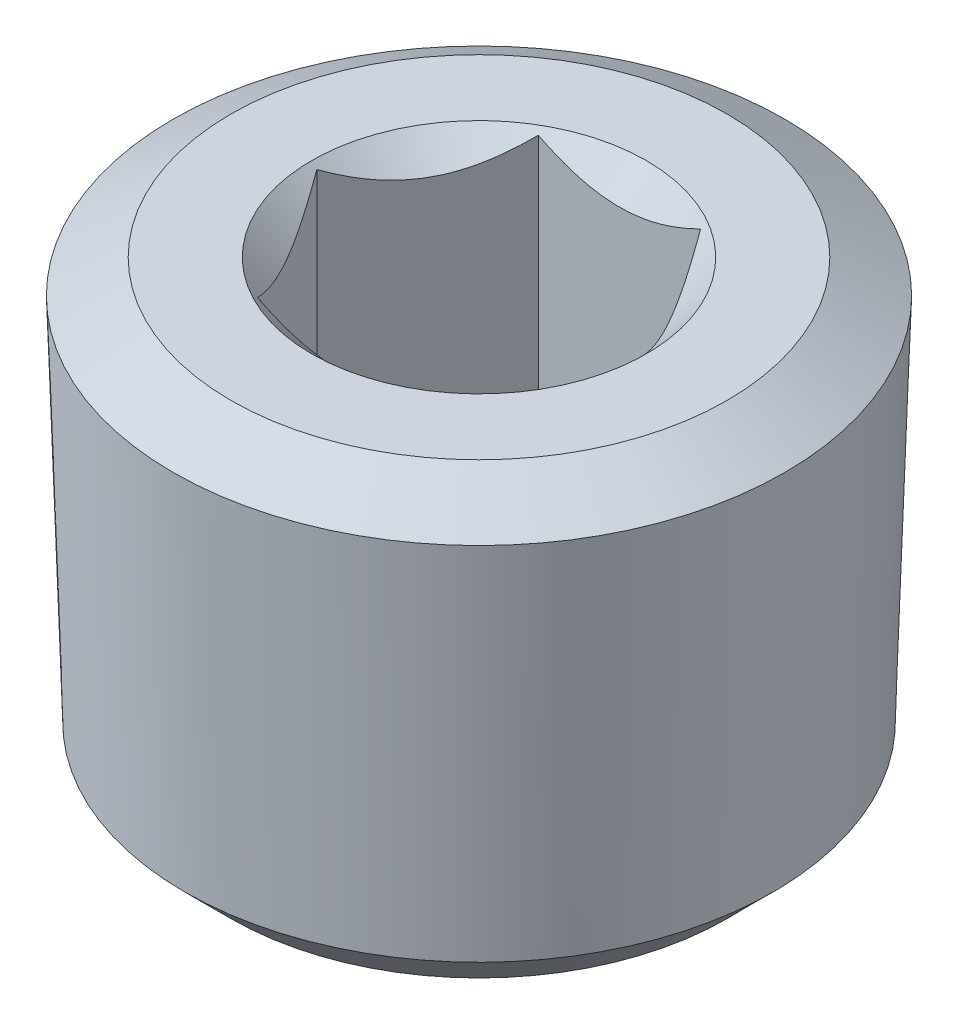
ISO-10303-21;
HEADER;
FILE_DESCRIPTION(('STEP AP214'),'2;1');
FILE_NAME('part.step','',(''),(''),'','','');
FILE_SCHEMA(('AUTOMOTIVE_DESIGN { 1 0 10303 214 1 1 1 1 }'));
ENDSEC;
DATA;
#1=APPLICATION_CONTEXT('core data for automotive mechanical design processes');
#2=APPLICATION_PROTOCOL_DEFINITION('international standard','automotive_design',2000,#1);
#3=PRODUCT_CONTEXT('',#1,'mechanical');
#4=PRODUCT('Part','Part','',(#3));
#5=PRODUCT_RELATED_PRODUCT_CATEGORY('part','',(#4));
#6=PRODUCT_DEFINITION_FORMATION('','',#4);
#7=PRODUCT_DEFINITION_CONTEXT('part definition',#1,'design');
#8=PRODUCT_DEFINITION('design','',#6,#7);
#9=PRODUCT_DEFINITION_SHAPE('','',#8);
#10=(LENGTH_UNIT() NAMED_UNIT(*) SI_UNIT(.MILLI.,.METRE.));
#11=(NAMED_UNIT(*) PLANE_ANGLE_UNIT() SI_UNIT($,.RADIAN.));
#12=(NAMED_UNIT(*) SI_UNIT($,.STERADIAN.) SOLID_ANGLE_UNIT());
#13=UNCERTAINTY_MEASURE_WITH_UNIT(LENGTH_MEASURE(1.E-05),#10,'distance_accuracy_value','');
#14=(GEOMETRIC_REPRESENTATION_CONTEXT(3) GLOBAL_UNCERTAINTY_ASSIGNED_CONTEXT((#13)) GLOBAL_UNIT_ASSIGNED_CONTEXT((#10,
#11,#12)) REPRESENTATION_CONTEXT('',''));
#15=CARTESIAN_POINT('',(0.,0.,0.));
#16=DIRECTION('',(0.,0.,1.));
#17=DIRECTION('',(1.,0.,0.));
#18=AXIS2_PLACEMENT_3D('',#15,#16,#17);
#19=CARTESIAN_POINT('',(0.,0.,0.));
#20=DIRECTION('',(0.,1.,0.));
#21=DIRECTION('',(0.,0.,1.));
#22=AXIS2_PLACEMENT_3D('',#19,#20,#21);
#23=PLANE('',#22);
#24=CARTESIAN_POINT('',(0.,0.,0.));
#25=DIRECTION('',(0.,1.,0.));
#26=DIRECTION('',(0.,0.,1.));
#27=AXIS2_PLACEMENT_3D('',#24,#25,#26);
#28=CIRCLE('',#27,4.7371);
#29=CARTESIAN_POINT('',(0.,0.,4.7371));
#30=VERTEX_POINT('',#29);
#31=EDGE_CURVE('E244',#30,#30,#28,.T.);
#32=ORIENTED_EDGE('',*,*,#31,.F.);
#33=EDGE_LOOP('',(#32));
#34=FACE_BOUND('',#33,.T.);
#35=CARTESIAN_POINT('',(0.,0.,0.));
#36=DIRECTION('',(0.,1.,0.));
#37=DIRECTION('',(0.,0.,1.));
#38=AXIS2_PLACEMENT_3D('',#35,#36,#37);
#39=CIRCLE('',#38,7.02034891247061);
#40=CARTESIAN_POINT('',(0.,0.,7.02034891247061));
#41=VERTEX_POINT('',#40);
#42=EDGE_CURVE('E12',#41,#41,#39,.T.);
#43=ORIENTED_EDGE('',*,*,#42,.T.);
#44=EDGE_LOOP('',(#43));
#45=FACE_BOUND('',#44,.T.);
#46=ADVANCED_FACE('F33',(#34,#45),#23,.T.);
#47=CARTESIAN_POINT('',(0.,0.,0.));
#48=DIRECTION('',(0.,-1.,0.));
#49=DIRECTION('',(0.,0.,-1.));
#50=AXIS2_PLACEMENT_3D('',#47,#48,#49);
#51=CONICAL_SURFACE('',#50,7.02034891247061,1.0471975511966);
#52=CARTESIAN_POINT('',(0.,-0.945092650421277,0.));
#53=DIRECTION('',(0.,1.,0.));
#54=DIRECTION('',(0.,0.,1.));
#55=AXIS2_PLACEMENT_3D('',#52,#53,#54);
#56=CIRCLE('',#55,8.65729740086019);
#57=CARTESIAN_POINT('',(0.,-0.945092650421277,8.65729740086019));
#58=VERTEX_POINT('',#57);
#59=EDGE_CURVE('E40',#58,#58,#56,.T.);
#60=ORIENTED_EDGE('',*,*,#59,.T.);
#61=EDGE_LOOP('',(#60));
#62=FACE_BOUND('',#61,.T.);
#63=ORIENTED_EDGE('',*,*,#42,.F.);
#64=EDGE_LOOP('',(#63));
#65=FACE_BOUND('',#64,.T.);
#66=ADVANCED_FACE('F234',(#62,#65),#51,.T.);
#67=CARTESIAN_POINT('',(0.,-0.945092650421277,0.));
#68=DIRECTION('',(0.,1.,0.));
#69=DIRECTION('',(0.,0.,1.));
#70=AXIS2_PLACEMENT_3D('',#67,#68,#69);
#71=CONICAL_SURFACE('',#70,8.65729740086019,0.0312064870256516);
#72=CARTESIAN_POINT('',(0.,-11.389077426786,0.));
#73=DIRECTION('',(0.,1.,0.));
#74=DIRECTION('',(0.,0.,1.));
#75=AXIS2_PLACEMENT_3D('',#72,#73,#74);
#76=CIRCLE('',#75,8.33127148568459);
#77=CARTESIAN_POINT('',(0.,-11.389077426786,8.33127148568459));
#78=VERTEX_POINT('',#77);
#79=EDGE_CURVE('E252',#78,#78,#76,.T.);
#80=ORIENTED_EDGE('',*,*,#79,.T.);
#81=EDGE_LOOP('',(#80));
#82=FACE_BOUND('',#81,.T.);
#83=ORIENTED_EDGE('',*,*,#59,.F.);
#84=EDGE_LOOP('',(#83));
#85=FACE_BOUND('',#84,.T.);
#86=ADVANCED_FACE('F239',(#82,#85),#71,.T.);
#87=CARTESIAN_POINT('',(0.,-11.389077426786,0.));
#88=DIRECTION('',(0.,1.,0.));
#89=DIRECTION('',(0.,0.,1.));
#90=AXIS2_PLACEMENT_3D('',#87,#88,#89);
#91=CONICAL_SURFACE('',#90,8.33127148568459,0.785398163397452);
#92=CARTESIAN_POINT('',(0.,-12.7,0.));
#93=DIRECTION('',(0.,1.,0.));
#94=DIRECTION('',(0.,0.,1.));
#95=AXIS2_PLACEMENT_3D('',#92,#93,#94);
#96=CIRCLE('',#95,7.02034891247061);
#97=CARTESIAN_POINT('',(0.,-12.7,7.02034891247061));
#98=VERTEX_POINT('',#97);
#99=EDGE_CURVE('E248',#98,#98,#96,.T.);
#100=ORIENTED_EDGE('',*,*,#99,.T.);
#101=EDGE_LOOP('',(#100));
#102=FACE_BOUND('',#101,.T.);
#103=ORIENTED_EDGE('',*,*,#79,.F.);
#104=EDGE_LOOP('',(#103));
#105=FACE_BOUND('',#104,.T.);
#106=ADVANCED_FACE('F263',(#102,#105),#91,.T.);
#107=CARTESIAN_POINT('',(-7.02034891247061,-12.7,0.));
#108=DIRECTION('',(0.,-1.,0.));
#109=DIRECTION('',(0.,0.,-1.));
#110=AXIS2_PLACEMENT_3D('',#107,#108,#109);
#111=PLANE('',#110);
#112=ORIENTED_EDGE('',*,*,#99,.F.);
#113=EDGE_LOOP('',(#112));
#114=FACE_BOUND('',#113,.T.);
#115=ADVANCED_FACE('F177',(#114),#111,.T.);
#116=CARTESIAN_POINT('',(0.,0.,0.));
#117=DIRECTION('',(0.,1.,0.));
#118=DIRECTION('',(0.,0.,1.));
#119=AXIS2_PLACEMENT_3D('',#116,#117,#118);
#120=CONICAL_SURFACE('',#119,4.7371,0.785398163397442);
#121=CARTESIAN_POINT('',(-4.84909764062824,1.53308085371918,3.9751));
#122=CARTESIAN_POINT('',(-4.73217167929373,1.44267539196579,3.9751));
#123=CARTESIAN_POINT('',(-4.61462251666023,1.35306340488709,3.9751));
#124=CARTESIAN_POINT('',(-4.37802066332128,1.17579084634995,3.9751));
#125=CARTESIAN_POINT('',(-4.25896762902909,1.08813073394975,3.9751));
#126=CARTESIAN_POINT('',(-4.01823171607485,0.914502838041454,3.9751));
#127=CARTESIAN_POINT('',(-3.89653564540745,0.828553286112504,3.9751));
#128=CARTESIAN_POINT('',(-3.65113000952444,0.659588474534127,3.9751));
#129=CARTESIAN_POINT('',(-3.52742058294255,0.576573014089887,3.9751));
#130=CARTESIAN_POINT('',(-3.26950382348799,0.408855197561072,3.9751));
#131=CARTESIAN_POINT('',(-3.13513782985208,0.324395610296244,3.9751));
#132=CARTESIAN_POINT('',(-2.86324687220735,0.160636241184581,3.9751));
#133=CARTESIAN_POINT('',(-2.72572137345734,0.0813373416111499,3.9751));
#134=CARTESIAN_POINT('',(-2.44745996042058,-0.0704182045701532,3.9751));
#135=CARTESIAN_POINT('',(-2.30673507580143,-0.142894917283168,3.9751));
#136=CARTESIAN_POINT('',(-2.02127023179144,-0.279382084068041,3.9751));
#137=CARTESIAN_POINT('',(-1.87653222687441,-0.343396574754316,3.9751));
#138=CARTESIAN_POINT('',(-1.5978890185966,-0.454566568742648,3.9751));
#139=CARTESIAN_POINT('',(-1.46441051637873,-0.502780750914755,3.9751));
#140=CARTESIAN_POINT('',(-1.19400195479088,-0.588529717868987,3.9751));
#141=CARTESIAN_POINT('',(-1.05707168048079,-0.626063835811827,3.9751));
#142=CARTESIAN_POINT('',(-0.782993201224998,-0.687773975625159,3.9751));
#143=CARTESIAN_POINT('',(-0.645901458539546,-0.712196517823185,3.9751));
#144=CARTESIAN_POINT('',(-0.36994953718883,-0.747165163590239,3.9751));
#145=CARTESIAN_POINT('',(-0.231089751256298,-0.757714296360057,3.9751));
#146=CARTESIAN_POINT('',(0.0405804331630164,-0.764005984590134,3.9751));
#147=CARTESIAN_POINT('',(0.173375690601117,-0.760406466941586,3.9751));
#148=CARTESIAN_POINT('',(0.437956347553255,-0.740123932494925,3.9751));
#149=CARTESIAN_POINT('',(0.569741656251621,-0.723439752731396,3.9751));
#150=CARTESIAN_POINT('',(0.833584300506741,-0.677656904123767,3.9751));
#151=CARTESIAN_POINT('',(0.965602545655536,-0.648336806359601,3.9751));
#152=CARTESIAN_POINT('',(1.22672185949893,-0.578926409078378,3.9751));
#153=CARTESIAN_POINT('',(1.35582307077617,-0.538836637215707,3.9751));
#154=CARTESIAN_POINT('',(1.61707549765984,-0.447503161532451,3.9751));
#155=CARTESIAN_POINT('',(1.74906788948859,-0.395810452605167,3.9751));
#156=CARTESIAN_POINT('',(2.0096644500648,-0.284428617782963,3.9751));
#157=CARTESIAN_POINT('',(2.13826707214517,-0.224735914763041,3.9751));
#158=CARTESIAN_POINT('',(2.39268673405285,-0.0987689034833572,3.9751));
#159=CARTESIAN_POINT('',(2.51849370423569,-0.0324744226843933,3.9751));
#160=CARTESIAN_POINT('',(2.76722744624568,0.105238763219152,3.9751));
#161=CARTESIAN_POINT('',(2.89015465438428,0.176656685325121,3.9751));
#162=CARTESIAN_POINT('',(3.12750338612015,0.31999408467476,3.9751));
#163=CARTESIAN_POINT('',(3.24204539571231,0.391715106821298,3.9751));
#164=CARTESIAN_POINT('',(3.4691612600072,0.538217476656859,3.9751));
#165=CARTESIAN_POINT('',(3.58173496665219,0.612999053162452,3.9751));
#166=CARTESIAN_POINT('',(3.80426855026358,0.764470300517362,3.9751));
#167=CARTESIAN_POINT('',(3.91424213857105,0.841139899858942,3.9751));
#168=CARTESIAN_POINT('',(4.13267949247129,0.996540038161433,3.9751));
#169=CARTESIAN_POINT('',(4.24114366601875,1.07527000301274,3.9751));
#170=CARTESIAN_POINT('',(4.34897443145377,1.15484353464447,3.9751));
#171=B_SPLINE_CURVE_WITH_KNOTS('',3,(#121,#122,#123,#124,#125,#126,#127,#128,#129,#130,#131,
#132,#133,#134,#135,#136,#137,#138,#139,#140,#141,#142,#143,#144,#145,#146,#147,#148,#149,#150,
#151,#152,#153,#154,#155,#156,#157,#158,#159,#160,#161,#162,#163,#164,#165,#166,#167,#168,#169,
#170),.UNSPECIFIED.,.F.,.F.,(4,2,2,2,2,2,2,2,2,2,2,2,2,2,2,2,2,2,2,2,2,2,2,2,4),(0.,
0.443407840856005,0.886918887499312,1.33384544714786,1.78074136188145,2.25676766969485,
2.73287514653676,3.20753536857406,3.6819683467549,4.10736140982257,4.53278102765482,
4.94989388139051,5.36691564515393,5.76478013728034,6.16267999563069,6.56785572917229,
6.97301161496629,7.39794831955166,7.82307566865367,8.24954441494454,8.67594812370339,
9.08132177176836,9.48672578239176,9.8888838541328,10.2909310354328),.UNSPECIFIED.);
#172=CARTESIAN_POINT('',(2.29502505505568,-0.14704988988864,3.9751));
#173=VERTEX_POINT('',#172);
#174=CARTESIAN_POINT('',(-2.29502505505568,-0.14704988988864,3.9751));
#175=VERTEX_POINT('',#174);
#176=EDGE_CURVE('E47',#173,#175,#171,.F.);
#177=ORIENTED_EDGE('',*,*,#176,.T.);
#178=CARTESIAN_POINT('',(-2.29490958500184,-0.146934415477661,3.9753));
#179=CARTESIAN_POINT('',(-2.33437312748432,-0.186393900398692,3.90694713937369));
#180=CARTESIAN_POINT('',(-2.37413865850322,-0.224642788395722,3.838071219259));
#181=CARTESIAN_POINT('',(-2.45433590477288,-0.298350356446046,3.69916551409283));
#182=CARTESIAN_POINT('',(-2.49476796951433,-0.333807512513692,3.62913512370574));
#183=CARTESIAN_POINT('',(-2.6175329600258,-0.435740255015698,3.41649992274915));
#184=CARTESIAN_POINT('',(-2.7009092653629,-0.49734220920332,3.27208792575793));
#185=CARTESIAN_POINT('',(-2.86901166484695,-0.602838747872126,2.9809260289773));
#186=CARTESIAN_POINT('',(-2.95369529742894,-0.646998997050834,2.83424967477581));
#187=CARTESIAN_POINT('',(-3.12493250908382,-0.715042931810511,2.53765812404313));
#188=CARTESIAN_POINT('',(-3.21148084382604,-0.738977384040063,2.38775201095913));
#189=CARTESIAN_POINT('',(-3.36064344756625,-0.760571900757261,2.12939480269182));
#190=CARTESIAN_POINT('',(-3.42306553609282,-0.763767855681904,2.02127657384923));
#191=CARTESIAN_POINT('',(-3.54780839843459,-0.758380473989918,1.80521559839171));
#192=CARTESIAN_POINT('',(-3.61012912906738,-0.749793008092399,1.69727292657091));
#193=CARTESIAN_POINT('',(-3.73418008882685,-0.721328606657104,1.48241036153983));
#194=CARTESIAN_POINT('',(-3.79590957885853,-0.701439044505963,1.37549174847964));
#195=CARTESIAN_POINT('',(-3.9183083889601,-0.651456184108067,1.16349079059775));
#196=CARTESIAN_POINT('',(-3.97897778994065,-0.621363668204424,1.05840830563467));
#197=CARTESIAN_POINT('',(-4.08668064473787,-0.559451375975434,0.871861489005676));
#198=CARTESIAN_POINT('',(-4.13395255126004,-0.529259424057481,0.789984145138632));
#199=CARTESIAN_POINT('',(-4.22764774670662,-0.464009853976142,0.62769930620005));
#200=CARTESIAN_POINT('',(-4.27407100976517,-0.428952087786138,0.547291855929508));
#201=CARTESIAN_POINT('',(-4.36592265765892,-0.354756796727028,0.388200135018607));
#202=CARTESIAN_POINT('',(-4.41135365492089,-0.315632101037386,0.309511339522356));
#203=CARTESIAN_POINT('',(-4.50137431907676,-0.233816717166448,0.153590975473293));
#204=CARTESIAN_POINT('',(-4.54596448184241,-0.191128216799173,0.0763585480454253));
#205=CARTESIAN_POINT('',(-4.5901655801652,-0.14693441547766,-0.000199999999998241));
#206=B_SPLINE_CURVE_WITH_KNOTS('',3,(#178,#179,#180,#181,#182,#183,#184,#185,#186,#187,#188,
#189,#190,#191,#192,#193,#194,#195,#196,#197,#198,#199,#200,#201,#202,#203,#204,#205),
.UNSPECIFIED.,.F.,.F.,(4,2,2,2,2,2,2,2,2,2,2,2,2,4),(0.,0.264704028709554,0.529551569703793,
1.0621063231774,1.58620390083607,2.10898205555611,2.48310879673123,2.85736667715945,
3.23204349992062,3.60669159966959,3.90429483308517,4.20190712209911,4.49860754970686,
4.79512715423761),.UNSPECIFIED.);
#207=CARTESIAN_POINT('',(-4.59005011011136,-0.147049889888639,0.));
#208=VERTEX_POINT('',#207);
#209=EDGE_CURVE('E119',#175,#208,#206,.T.);
#210=ORIENTED_EDGE('',*,*,#209,.T.);
#211=CARTESIAN_POINT('',(-4.5901655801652,-0.14693441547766,0.000200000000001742));
#212=CARTESIAN_POINT('',(-4.55070203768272,-0.186393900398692,-0.0681528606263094));
#213=CARTESIAN_POINT('',(-4.51093650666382,-0.224642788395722,-0.137028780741));
#214=CARTESIAN_POINT('',(-4.43073926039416,-0.298350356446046,-0.275934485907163));
#215=CARTESIAN_POINT('',(-4.39030719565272,-0.333807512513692,-0.345964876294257));
#216=CARTESIAN_POINT('',(-4.26754220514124,-0.435740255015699,-0.558600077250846));
#217=CARTESIAN_POINT('',(-4.18416589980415,-0.49734220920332,-0.703012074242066));
#218=CARTESIAN_POINT('',(-4.01606350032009,-0.602838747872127,-0.994173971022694));
#219=CARTESIAN_POINT('',(-3.9313798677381,-0.646998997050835,-1.14085032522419));
#220=CARTESIAN_POINT('',(-3.76014265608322,-0.715042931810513,-1.43744187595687));
#221=CARTESIAN_POINT('',(-3.673594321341,-0.738977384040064,-1.58734798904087));
#222=CARTESIAN_POINT('',(-3.52443171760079,-0.760571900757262,-1.84570519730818));
#223=CARTESIAN_POINT('',(-3.46200962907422,-0.763767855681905,-1.95382342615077));
#224=CARTESIAN_POINT('',(-3.33726676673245,-0.758380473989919,-2.16988440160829));
#225=CARTESIAN_POINT('',(-3.27494603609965,-0.7497930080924,-2.27782707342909));
#226=CARTESIAN_POINT('',(-3.15089507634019,-0.721328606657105,-2.49268963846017));
#227=CARTESIAN_POINT('',(-3.0891655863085,-0.701439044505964,-2.59960825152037));
#228=CARTESIAN_POINT('',(-2.96676677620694,-0.651456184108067,-2.81160920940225));
#229=CARTESIAN_POINT('',(-2.90609737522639,-0.621363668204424,-2.91669169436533));
#230=CARTESIAN_POINT('',(-2.79839452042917,-0.559451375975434,-3.10323851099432));
#231=CARTESIAN_POINT('',(-2.751122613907,-0.529259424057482,-3.18511585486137));
#232=CARTESIAN_POINT('',(-2.65742741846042,-0.464009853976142,-3.34740069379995));
#233=CARTESIAN_POINT('',(-2.61100415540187,-0.428952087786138,-3.42780814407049));
#234=CARTESIAN_POINT('',(-2.51915250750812,-0.354756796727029,-3.58689986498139));
#235=CARTESIAN_POINT('',(-2.47372151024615,-0.315632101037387,-3.66558866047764));
#236=CARTESIAN_POINT('',(-2.38370084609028,-0.23381671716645,-3.82150902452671));
#237=CARTESIAN_POINT('',(-2.33911068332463,-0.191128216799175,-3.89874145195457));
#238=CARTESIAN_POINT('',(-2.29490958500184,-0.146934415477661,-3.9753));
#239=B_SPLINE_CURVE_WITH_KNOTS('',3,(#211,#212,#213,#214,#215,#216,#217,#218,#219,#220,#221,
#222,#223,#224,#225,#226,#227,#228,#229,#230,#231,#232,#233,#234,#235,#236,#237,#238),
.UNSPECIFIED.,.F.,.F.,(4,2,2,2,2,2,2,2,2,2,2,2,2,4),(0.,0.264704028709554,0.529551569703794,
1.0621063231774,1.58620390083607,2.10898205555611,2.48310879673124,2.85736667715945,
3.23204349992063,3.6066915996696,3.90429483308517,4.20190712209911,4.49860754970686,
4.79512715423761),.UNSPECIFIED.);
#240=CARTESIAN_POINT('',(-2.29502505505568,-0.147049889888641,-3.9751));
#241=VERTEX_POINT('',#240);
#242=EDGE_CURVE('E201',#208,#241,#239,.T.);
#243=ORIENTED_EDGE('',*,*,#242,.T.);
#244=CARTESIAN_POINT('',(-4.84909764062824,1.53308085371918,-3.9751));
#245=CARTESIAN_POINT('',(-4.73217167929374,1.44267539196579,-3.9751));
#246=CARTESIAN_POINT('',(-4.61462251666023,1.3530634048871,-3.9751));
#247=CARTESIAN_POINT('',(-4.37802066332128,1.17579084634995,-3.9751));
#248=CARTESIAN_POINT('',(-4.25896762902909,1.08813073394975,-3.9751));
#249=CARTESIAN_POINT('',(-4.01823171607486,0.914502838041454,-3.9751));
#250=CARTESIAN_POINT('',(-3.89653564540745,0.828553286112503,-3.9751));
#251=CARTESIAN_POINT('',(-3.65113000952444,0.659588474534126,-3.9751));
#252=CARTESIAN_POINT('',(-3.52742058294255,0.576573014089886,-3.9751));
#253=CARTESIAN_POINT('',(-3.26950382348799,0.408855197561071,-3.9751));
#254=CARTESIAN_POINT('',(-3.13513782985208,0.324395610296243,-3.9751));
#255=CARTESIAN_POINT('',(-2.86324687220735,0.16063624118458,-3.9751));
#256=CARTESIAN_POINT('',(-2.72572137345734,0.0813373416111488,-3.9751));
#257=CARTESIAN_POINT('',(-2.44745996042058,-0.0704182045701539,-3.9751));
#258=CARTESIAN_POINT('',(-2.30673507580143,-0.142894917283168,-3.9751));
#259=CARTESIAN_POINT('',(-2.02127023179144,-0.279382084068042,-3.9751));
#260=CARTESIAN_POINT('',(-1.87653222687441,-0.343396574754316,-3.9751));
#261=CARTESIAN_POINT('',(-1.5978890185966,-0.454566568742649,-3.9751));
#262=CARTESIAN_POINT('',(-1.46441051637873,-0.502780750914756,-3.9751));
#263=CARTESIAN_POINT('',(-1.19400195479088,-0.588529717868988,-3.9751));
#264=CARTESIAN_POINT('',(-1.05707168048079,-0.626063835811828,-3.9751));
#265=CARTESIAN_POINT('',(-0.782993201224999,-0.687773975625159,-3.9751));
#266=CARTESIAN_POINT('',(-0.645901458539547,-0.712196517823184,-3.9751));
#267=CARTESIAN_POINT('',(-0.369949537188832,-0.747165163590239,-3.9751));
#268=CARTESIAN_POINT('',(-0.231089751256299,-0.757714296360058,-3.9751));
#269=CARTESIAN_POINT('',(0.040580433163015,-0.764005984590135,-3.9751));
#270=CARTESIAN_POINT('',(0.173375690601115,-0.760406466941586,-3.9751));
#271=CARTESIAN_POINT('',(0.437956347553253,-0.740123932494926,-3.9751));
#272=CARTESIAN_POINT('',(0.569741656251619,-0.723439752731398,-3.9751));
#273=CARTESIAN_POINT('',(0.83358430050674,-0.677656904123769,-3.9751));
#274=CARTESIAN_POINT('',(0.965602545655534,-0.648336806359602,-3.9751));
#275=CARTESIAN_POINT('',(1.22672185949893,-0.578926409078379,-3.9751));
#276=CARTESIAN_POINT('',(1.35582307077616,-0.538836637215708,-3.9751));
#277=CARTESIAN_POINT('',(1.61707549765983,-0.447503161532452,-3.9751));
#278=CARTESIAN_POINT('',(1.74906788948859,-0.395810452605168,-3.9751));
#279=CARTESIAN_POINT('',(2.0096644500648,-0.284428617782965,-3.9751));
#280=CARTESIAN_POINT('',(2.13826707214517,-0.224735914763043,-3.9751));
#281=CARTESIAN_POINT('',(2.39268673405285,-0.0987689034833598,-3.9751));
#282=CARTESIAN_POINT('',(2.51849370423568,-0.0324744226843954,-3.9751));
#283=CARTESIAN_POINT('',(2.76722744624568,0.10523876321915,-3.9751));
#284=CARTESIAN_POINT('',(2.89015465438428,0.176656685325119,-3.9751));
#285=CARTESIAN_POINT('',(3.12750338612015,0.319994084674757,-3.9751));
#286=CARTESIAN_POINT('',(3.24204539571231,0.391715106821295,-3.9751));
#287=CARTESIAN_POINT('',(3.4691612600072,0.538217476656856,-3.9751));
#288=CARTESIAN_POINT('',(3.58173496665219,0.612999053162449,-3.9751));
#289=CARTESIAN_POINT('',(3.80426855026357,0.764470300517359,-3.9751));
#290=CARTESIAN_POINT('',(3.91424213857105,0.841139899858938,-3.9751));
#291=CARTESIAN_POINT('',(4.13267949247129,0.996540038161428,-3.9751));
#292=CARTESIAN_POINT('',(4.24114366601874,1.07527000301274,-3.9751));
#293=CARTESIAN_POINT('',(4.34897443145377,1.15484353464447,-3.9751));
#294=B_SPLINE_CURVE_WITH_KNOTS('',3,(#244,#245,#246,#247,#248,#249,#250,#251,#252,#253,#254,
#255,#256,#257,#258,#259,#260,#261,#262,#263,#264,#265,#266,#267,#268,#269,#270,#271,#272,#273,
#274,#275,#276,#277,#278,#279,#280,#281,#282,#283,#284,#285,#286,#287,#288,#289,#290,#291,#292,
#293),.UNSPECIFIED.,.F.,.F.,(4,2,2,2,2,2,2,2,2,2,2,2,2,2,2,2,2,2,2,2,2,2,2,2,4),(0.,
0.443407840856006,0.886918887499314,1.33384544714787,1.78074136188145,2.25676766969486,
2.73287514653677,3.20753536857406,3.6819683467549,4.10736140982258,4.53278102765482,
4.94989388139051,5.36691564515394,5.76478013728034,6.16267999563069,6.56785572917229,
6.97301161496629,7.39794831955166,7.82307566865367,8.24954441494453,8.67594812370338,
9.08132177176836,9.48672578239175,9.8888838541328,10.2909310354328),.UNSPECIFIED.);
#295=CARTESIAN_POINT('',(2.29502505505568,-0.147049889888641,-3.9751));
#296=VERTEX_POINT('',#295);
#297=EDGE_CURVE('E194',#241,#296,#294,.T.);
#298=ORIENTED_EDGE('',*,*,#297,.T.);
#299=CARTESIAN_POINT('',(2.29490958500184,-0.146934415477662,-3.9753));
#300=CARTESIAN_POINT('',(2.33437312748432,-0.186393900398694,-3.90694713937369));
#301=CARTESIAN_POINT('',(2.37413865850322,-0.224642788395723,-3.838071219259));
#302=CARTESIAN_POINT('',(2.45433590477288,-0.298350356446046,-3.69916551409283));
#303=CARTESIAN_POINT('',(2.49476796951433,-0.333807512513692,-3.62913512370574));
#304=CARTESIAN_POINT('',(2.6175329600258,-0.435740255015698,-3.41649992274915));
#305=CARTESIAN_POINT('',(2.70090926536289,-0.497342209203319,-3.27208792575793));
#306=CARTESIAN_POINT('',(2.86901166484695,-0.602838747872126,-2.98092602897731));
#307=CARTESIAN_POINT('',(2.95369529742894,-0.646998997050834,-2.83424967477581));
#308=CARTESIAN_POINT('',(3.12493250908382,-0.715042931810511,-2.53765812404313));
#309=CARTESIAN_POINT('',(3.21148084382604,-0.738977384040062,-2.38775201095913));
#310=CARTESIAN_POINT('',(3.36064344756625,-0.760571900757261,-2.12939480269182));
#311=CARTESIAN_POINT('',(3.42306553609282,-0.763767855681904,-2.02127657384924));
#312=CARTESIAN_POINT('',(3.54780839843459,-0.758380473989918,-1.80521559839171));
#313=CARTESIAN_POINT('',(3.61012912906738,-0.749793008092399,-1.69727292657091));
#314=CARTESIAN_POINT('',(3.73418008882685,-0.721328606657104,-1.48241036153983));
#315=CARTESIAN_POINT('',(3.79590957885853,-0.701439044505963,-1.37549174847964));
#316=CARTESIAN_POINT('',(3.9183083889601,-0.651456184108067,-1.16349079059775));
#317=CARTESIAN_POINT('',(3.97897778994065,-0.621363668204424,-1.05840830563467));
#318=CARTESIAN_POINT('',(4.08668064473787,-0.559451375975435,-0.871861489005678));
#319=CARTESIAN_POINT('',(4.13395255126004,-0.529259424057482,-0.789984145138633));
#320=CARTESIAN_POINT('',(4.22764774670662,-0.464009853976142,-0.62769930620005));
#321=CARTESIAN_POINT('',(4.27407100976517,-0.428952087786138,-0.547291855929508));
#322=CARTESIAN_POINT('',(4.36592265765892,-0.354756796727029,-0.388200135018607));
#323=CARTESIAN_POINT('',(4.41135365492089,-0.315632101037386,-0.309511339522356));
#324=CARTESIAN_POINT('',(4.50137431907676,-0.233816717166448,-0.153590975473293));
#325=CARTESIAN_POINT('',(4.54596448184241,-0.191128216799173,-0.076358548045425));
#326=CARTESIAN_POINT('',(4.5901655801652,-0.14693441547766,0.000199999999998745));
#327=B_SPLINE_CURVE_WITH_KNOTS('',3,(#299,#300,#301,#302,#303,#304,#305,#306,#307,#308,#309,
#310,#311,#312,#313,#314,#315,#316,#317,#318,#319,#320,#321,#322,#323,#324,#325,#326),
.UNSPECIFIED.,.F.,.F.,(4,2,2,2,2,2,2,2,2,2,2,2,2,4),(0.,0.264704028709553,0.529551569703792,
1.06210632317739,1.58620390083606,2.10898205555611,2.48310879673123,2.85736667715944,
3.23204349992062,3.60669159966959,3.90429483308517,4.20190712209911,4.49860754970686,
4.79512715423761),.UNSPECIFIED.);
#328=CARTESIAN_POINT('',(4.59005011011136,-0.147049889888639,0.));
#329=VERTEX_POINT('',#328);
#330=EDGE_CURVE('E187',#296,#329,#327,.T.);
#331=ORIENTED_EDGE('',*,*,#330,.T.);
#332=CARTESIAN_POINT('',(4.5901655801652,-0.14693441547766,-0.000200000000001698));
#333=CARTESIAN_POINT('',(4.55070203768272,-0.186393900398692,0.0681528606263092));
#334=CARTESIAN_POINT('',(4.51093650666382,-0.224642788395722,0.137028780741));
#335=CARTESIAN_POINT('',(4.43073926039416,-0.298350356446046,0.275934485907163));
#336=CARTESIAN_POINT('',(4.39030719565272,-0.333807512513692,0.345964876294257));
#337=CARTESIAN_POINT('',(4.26754220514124,-0.435740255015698,0.558600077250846));
#338=CARTESIAN_POINT('',(4.18416589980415,-0.49734220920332,0.703012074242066));
#339=CARTESIAN_POINT('',(4.01606350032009,-0.602838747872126,0.994173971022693));
#340=CARTESIAN_POINT('',(3.9313798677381,-0.646998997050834,1.14085032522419));
#341=CARTESIAN_POINT('',(3.76014265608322,-0.715042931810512,1.43744187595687));
#342=CARTESIAN_POINT('',(3.673594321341,-0.738977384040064,1.58734798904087));
#343=CARTESIAN_POINT('',(3.52443171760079,-0.760571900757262,1.84570519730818));
#344=CARTESIAN_POINT('',(3.46200962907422,-0.763767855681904,1.95382342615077));
#345=CARTESIAN_POINT('',(3.33726676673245,-0.758380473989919,2.16988440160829));
#346=CARTESIAN_POINT('',(3.27494603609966,-0.749793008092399,2.27782707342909));
#347=CARTESIAN_POINT('',(3.15089507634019,-0.721328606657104,2.49268963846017));
#348=CARTESIAN_POINT('',(3.08916558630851,-0.701439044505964,2.59960825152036));
#349=CARTESIAN_POINT('',(2.96676677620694,-0.651456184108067,2.81160920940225));
#350=CARTESIAN_POINT('',(2.90609737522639,-0.621363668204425,2.91669169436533));
#351=CARTESIAN_POINT('',(2.79839452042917,-0.559451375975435,3.10323851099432));
#352=CARTESIAN_POINT('',(2.751122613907,-0.529259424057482,3.18511585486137));
#353=CARTESIAN_POINT('',(2.65742741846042,-0.464009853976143,3.34740069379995));
#354=CARTESIAN_POINT('',(2.61100415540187,-0.428952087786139,3.42780814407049));
#355=CARTESIAN_POINT('',(2.51915250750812,-0.35475679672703,3.58689986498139));
#356=CARTESIAN_POINT('',(2.47372151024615,-0.315632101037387,3.66558866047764));
#357=CARTESIAN_POINT('',(2.38370084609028,-0.23381671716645,3.82150902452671));
#358=CARTESIAN_POINT('',(2.33911068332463,-0.191128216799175,3.89874145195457));
#359=CARTESIAN_POINT('',(2.29490958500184,-0.146934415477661,3.9753));
#360=B_SPLINE_CURVE_WITH_KNOTS('',3,(#332,#333,#334,#335,#336,#337,#338,#339,#340,#341,#342,
#343,#344,#345,#346,#347,#348,#349,#350,#351,#352,#353,#354,#355,#356,#357,#358,#359),
.UNSPECIFIED.,.F.,.F.,(4,2,2,2,2,2,2,2,2,2,2,2,2,4),(0.,0.264704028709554,0.529551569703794,
1.0621063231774,1.58620390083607,2.10898205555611,2.48310879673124,2.85736667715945,
3.23204349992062,3.60669159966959,3.90429483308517,4.20190712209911,4.49860754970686,
4.79512715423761),.UNSPECIFIED.);
#361=EDGE_CURVE('E163',#329,#173,#360,.T.);
#362=ORIENTED_EDGE('',*,*,#361,.T.);
#363=EDGE_LOOP('',(#177,#210,#243,#298,#331,#362));
#364=FACE_BOUND('',#363,.T.);
#365=ORIENTED_EDGE('',*,*,#31,.T.);
#366=EDGE_LOOP('',(#365));
#367=FACE_BOUND('',#366,.T.);
#368=ADVANCED_FACE('F172',(#364,#367),#120,.F.);
#369=CARTESIAN_POINT('',(-4.59005011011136,-6.858,0.));
#370=DIRECTION('',(-0.866025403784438,0.,0.5));
#371=DIRECTION('',(0.5,0.,0.866025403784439));
#372=AXIS2_PLACEMENT_3D('',#369,#370,#371);
#373=PLANE('',#372);
#374=DIRECTION('',(0.,1.,0.));
#375=VECTOR('',#374,1.);
#376=CARTESIAN_POINT('',(-2.29502505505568,-6.858,3.9751));
#377=LINE('',#376,#375);
#378=CARTESIAN_POINT('',(-2.29502505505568,-6.858,3.9751));
#379=VERTEX_POINT('',#378);
#380=EDGE_CURVE('E116',#379,#175,#377,.T.);
#381=ORIENTED_EDGE('',*,*,#380,.F.);
#382=DIRECTION('',(0.5,0.,0.866025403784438));
#383=VECTOR('',#382,1.);
#384=CARTESIAN_POINT('',(-4.59005011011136,-6.858,0.));
#385=LINE('',#384,#383);
#386=CARTESIAN_POINT('',(-3.44253758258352,-6.858,1.98755));
#387=VERTEX_POINT('',#386);
#388=EDGE_CURVE('E103',#387,#379,#385,.T.);
#389=ORIENTED_EDGE('',*,*,#388,.F.);
#390=CARTESIAN_POINT('',(-4.59005011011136,-6.858,0.));
#391=VERTEX_POINT('',#390);
#392=EDGE_CURVE('E113',#391,#387,#385,.T.);
#393=ORIENTED_EDGE('',*,*,#392,.F.);
#394=DIRECTION('',(0.,1.,0.));
#395=VECTOR('',#394,1.);
#396=CARTESIAN_POINT('',(-4.59005011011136,-6.858,0.));
#397=LINE('',#396,#395);
#398=EDGE_CURVE('E143',#391,#208,#397,.T.);
#399=ORIENTED_EDGE('',*,*,#398,.T.);
#400=ORIENTED_EDGE('',*,*,#209,.F.);
#401=EDGE_LOOP('',(#381,#389,#393,#399,#400));
#402=FACE_BOUND('',#401,.T.);
#403=ADVANCED_FACE('F117',(#402),#373,.F.);
#404=CARTESIAN_POINT('',(-2.29502505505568,-6.858,-3.9751));
#405=DIRECTION('',(-0.866025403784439,0.,-0.5));
#406=DIRECTION('',(-0.5,0.,0.866025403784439));
#407=AXIS2_PLACEMENT_3D('',#404,#405,#406);
#408=PLANE('',#407);
#409=ORIENTED_EDGE('',*,*,#398,.F.);
#410=DIRECTION('',(-0.5,0.,0.866025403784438));
#411=VECTOR('',#410,1.);
#412=CARTESIAN_POINT('',(-2.29502505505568,-6.858,-3.9751));
#413=LINE('',#412,#411);
#414=CARTESIAN_POINT('',(-3.44253758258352,-6.858,-1.98755));
#415=VERTEX_POINT('',#414);
#416=EDGE_CURVE('E140',#415,#391,#413,.T.);
#417=ORIENTED_EDGE('',*,*,#416,.F.);
#418=CARTESIAN_POINT('',(-2.29502505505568,-6.858,-3.9751));
#419=VERTEX_POINT('',#418);
#420=EDGE_CURVE('E122',#419,#415,#413,.T.);
#421=ORIENTED_EDGE('',*,*,#420,.F.);
#422=DIRECTION('',(0.,1.,0.));
#423=VECTOR('',#422,1.);
#424=CARTESIAN_POINT('',(-2.29502505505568,-6.858,-3.9751));
#425=LINE('',#424,#423);
#426=EDGE_CURVE('E145',#419,#241,#425,.T.);
#427=ORIENTED_EDGE('',*,*,#426,.T.);
#428=ORIENTED_EDGE('',*,*,#242,.F.);
#429=EDGE_LOOP('',(#409,#417,#421,#427,#428));
#430=FACE_BOUND('',#429,.T.);
#431=ADVANCED_FACE('F212',(#430),#408,.F.);
#432=CARTESIAN_POINT('',(2.29502505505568,-6.858,-3.9751));
#433=DIRECTION('',(0.,0.,-1.));
#434=DIRECTION('',(-1.,0.,0.));
#435=AXIS2_PLACEMENT_3D('',#432,#433,#434);
#436=PLANE('',#435);
#437=ORIENTED_EDGE('',*,*,#426,.F.);
#438=DIRECTION('',(-1.,0.,0.));
#439=VECTOR('',#438,1.);
#440=CARTESIAN_POINT('',(2.29502505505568,-6.858,-3.9751));
#441=LINE('',#440,#439);
#442=CARTESIAN_POINT('',(0.,-6.858,-3.9751));
#443=VERTEX_POINT('',#442);
#444=EDGE_CURVE('E136',#443,#419,#441,.T.);
#445=ORIENTED_EDGE('',*,*,#444,.F.);
#446=CARTESIAN_POINT('',(2.29502505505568,-6.858,-3.9751));
#447=VERTEX_POINT('',#446);
#448=EDGE_CURVE('E137',#447,#443,#441,.T.);
#449=ORIENTED_EDGE('',*,*,#448,.F.);
#450=DIRECTION('',(0.,1.,0.));
#451=VECTOR('',#450,1.);
#452=CARTESIAN_POINT('',(2.29502505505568,-6.858,-3.9751));
#453=LINE('',#452,#451);
#454=EDGE_CURVE('E148',#447,#296,#453,.T.);
#455=ORIENTED_EDGE('',*,*,#454,.T.);
#456=ORIENTED_EDGE('',*,*,#297,.F.);
#457=EDGE_LOOP('',(#437,#445,#449,#455,#456));
#458=FACE_BOUND('',#457,.T.);
#459=ADVANCED_FACE('F216',(#458),#436,.F.);
#460=CARTESIAN_POINT('',(4.59005011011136,-6.858,0.));
#461=DIRECTION('',(0.866025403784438,0.,-0.5));
#462=DIRECTION('',(-0.5,0.,-0.866025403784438));
#463=AXIS2_PLACEMENT_3D('',#460,#461,#462);
#464=PLANE('',#463);
#465=ORIENTED_EDGE('',*,*,#454,.F.);
#466=DIRECTION('',(-0.5,0.,-0.866025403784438));
#467=VECTOR('',#466,1.);
#468=CARTESIAN_POINT('',(4.59005011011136,-6.858,0.));
#469=LINE('',#468,#467);
#470=CARTESIAN_POINT('',(3.44253758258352,-6.858,-1.98755));
#471=VERTEX_POINT('',#470);
#472=EDGE_CURVE('E132',#471,#447,#469,.T.);
#473=ORIENTED_EDGE('',*,*,#472,.F.);
#474=CARTESIAN_POINT('',(4.59005011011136,-6.858,0.));
#475=VERTEX_POINT('',#474);
#476=EDGE_CURVE('E133',#475,#471,#469,.T.);
#477=ORIENTED_EDGE('',*,*,#476,.F.);
#478=DIRECTION('',(0.,1.,0.));
#479=VECTOR('',#478,1.);
#480=CARTESIAN_POINT('',(4.59005011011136,-6.858,0.));
#481=LINE('',#480,#479);
#482=EDGE_CURVE('E151',#475,#329,#481,.T.);
#483=ORIENTED_EDGE('',*,*,#482,.T.);
#484=ORIENTED_EDGE('',*,*,#330,.F.);
#485=EDGE_LOOP('',(#465,#473,#477,#483,#484));
#486=FACE_BOUND('',#485,.T.);
#487=ADVANCED_FACE('F220',(#486),#464,.F.);
#488=CARTESIAN_POINT('',(2.29502505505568,-6.858,3.9751));
#489=DIRECTION('',(0.866025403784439,0.,0.5));
#490=DIRECTION('',(0.5,0.,-0.866025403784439));
#491=AXIS2_PLACEMENT_3D('',#488,#489,#490);
#492=PLANE('',#491);
#493=ORIENTED_EDGE('',*,*,#482,.F.);
#494=DIRECTION('',(0.5,0.,-0.866025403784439));
#495=VECTOR('',#494,1.);
#496=CARTESIAN_POINT('',(2.29502505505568,-6.858,3.9751));
#497=LINE('',#496,#495);
#498=CARTESIAN_POINT('',(3.44253758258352,-6.858,1.98755));
#499=VERTEX_POINT('',#498);
#500=EDGE_CURVE('E128',#499,#475,#497,.T.);
#501=ORIENTED_EDGE('',*,*,#500,.F.);
#502=CARTESIAN_POINT('',(2.29502505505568,-6.858,3.9751));
#503=VERTEX_POINT('',#502);
#504=EDGE_CURVE('E55',#503,#499,#497,.T.);
#505=ORIENTED_EDGE('',*,*,#504,.F.);
#506=DIRECTION('',(0.,1.,0.));
#507=VECTOR('',#506,1.);
#508=CARTESIAN_POINT('',(2.29502505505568,-6.858,3.9751));
#509=LINE('',#508,#507);
#510=EDGE_CURVE('E121',#503,#173,#509,.T.);
#511=ORIENTED_EDGE('',*,*,#510,.T.);
#512=ORIENTED_EDGE('',*,*,#361,.F.);
#513=EDGE_LOOP('',(#493,#501,#505,#511,#512));
#514=FACE_BOUND('',#513,.T.);
#515=ADVANCED_FACE('F224',(#514),#492,.F.);
#516=CARTESIAN_POINT('',(-2.29502505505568,-6.858,3.9751));
#517=DIRECTION('',(0.,0.,1.));
#518=DIRECTION('',(1.,0.,0.));
#519=AXIS2_PLACEMENT_3D('',#516,#517,#518);
#520=PLANE('',#519);
#521=ORIENTED_EDGE('',*,*,#510,.F.);
#522=DIRECTION('',(1.,0.,0.));
#523=VECTOR('',#522,1.);
#524=CARTESIAN_POINT('',(-2.29502505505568,-6.858,3.9751));
#525=LINE('',#524,#523);
#526=CARTESIAN_POINT('',(0.,-6.858,3.9751));
#527=VERTEX_POINT('',#526);
#528=EDGE_CURVE('E127',#527,#503,#525,.T.);
#529=ORIENTED_EDGE('',*,*,#528,.F.);
#530=EDGE_CURVE('E107',#379,#527,#525,.T.);
#531=ORIENTED_EDGE('',*,*,#530,.F.);
#532=ORIENTED_EDGE('',*,*,#380,.T.);
#533=ORIENTED_EDGE('',*,*,#176,.F.);
#534=EDGE_LOOP('',(#521,#529,#531,#532,#533));
#535=FACE_BOUND('',#534,.T.);
#536=ADVANCED_FACE('F126',(#535),#520,.F.);
#537=CARTESIAN_POINT('',(0.,-6.858,0.));
#538=DIRECTION('',(0.,1.,0.));
#539=DIRECTION('',(0.,0.,1.));
#540=AXIS2_PLACEMENT_3D('',#537,#538,#539);
#541=PLANE('',#540);
#542=CARTESIAN_POINT('',(0.,-6.858,0.));
#543=DIRECTION('',(0.,1.,0.));
#544=DIRECTION('',(0.,0.,1.));
#545=AXIS2_PLACEMENT_3D('',#542,#543,#544);
#546=CIRCLE('',#545,3.9751);
#547=EDGE_CURVE('E109',#387,#527,#546,.T.);
#548=ORIENTED_EDGE('',*,*,#547,.F.);
#549=ORIENTED_EDGE('',*,*,#388,.T.);
#550=ORIENTED_EDGE('',*,*,#530,.T.);
#551=EDGE_LOOP('',(#548,#549,#550));
#552=FACE_BOUND('',#551,.T.);
#553=ADVANCED_FACE('F105',(#552),#541,.T.);
#554=EDGE_CURVE('E414',#415,#387,#546,.T.);
#555=ORIENTED_EDGE('',*,*,#554,.F.);
#556=ORIENTED_EDGE('',*,*,#416,.T.);
#557=ORIENTED_EDGE('',*,*,#392,.T.);
#558=EDGE_LOOP('',(#555,#556,#557));
#559=FACE_BOUND('',#558,.T.);
#560=ADVANCED_FACE('F320',(#559),#541,.T.);
#561=EDGE_CURVE('E425',#443,#415,#546,.T.);
#562=ORIENTED_EDGE('',*,*,#561,.F.);
#563=ORIENTED_EDGE('',*,*,#444,.T.);
#564=ORIENTED_EDGE('',*,*,#420,.T.);
#565=EDGE_LOOP('',(#562,#563,#564));
#566=FACE_BOUND('',#565,.T.);
#567=ADVANCED_FACE('F329',(#566),#541,.T.);
#568=EDGE_CURVE('E426',#471,#443,#546,.T.);
#569=ORIENTED_EDGE('',*,*,#568,.F.);
#570=ORIENTED_EDGE('',*,*,#472,.T.);
#571=ORIENTED_EDGE('',*,*,#448,.T.);
#572=EDGE_LOOP('',(#569,#570,#571));
#573=FACE_BOUND('',#572,.T.);
#574=ADVANCED_FACE('F338',(#573),#541,.T.);
#575=EDGE_CURVE('E255',#499,#471,#546,.T.);
#576=ORIENTED_EDGE('',*,*,#575,.F.);
#577=ORIENTED_EDGE('',*,*,#500,.T.);
#578=ORIENTED_EDGE('',*,*,#476,.T.);
#579=EDGE_LOOP('',(#576,#577,#578));
#580=FACE_BOUND('',#579,.T.);
#581=ADVANCED_FACE('F347',(#580),#541,.T.);
#582=EDGE_CURVE('E249',#527,#499,#546,.T.);
#583=ORIENTED_EDGE('',*,*,#582,.F.);
#584=ORIENTED_EDGE('',*,*,#528,.T.);
#585=ORIENTED_EDGE('',*,*,#504,.T.);
#586=EDGE_LOOP('',(#583,#584,#585));
#587=FACE_BOUND('',#586,.T.);
#588=ADVANCED_FACE('F321',(#587),#541,.T.);
#589=CARTESIAN_POINT('',(-2.70691903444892,-7.62,0.));
#590=DIRECTION('',(0.,-1.,0.));
#591=DIRECTION('',(0.,0.,-1.));
#592=AXIS2_PLACEMENT_3D('',#589,#590,#591);
#593=PLANE('',#592);
#594=CARTESIAN_POINT('',(0.,-7.62,0.));
#595=DIRECTION('',(0.,1.,0.));
#596=DIRECTION('',(0.,0.,1.));
#597=AXIS2_PLACEMENT_3D('',#594,#595,#596);
#598=CIRCLE('',#597,2.70691903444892);
#599=CARTESIAN_POINT('',(0.,-7.62,2.70691903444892));
#600=VERTEX_POINT('',#599);
#601=EDGE_CURVE('E413',#600,#600,#598,.T.);
#602=ORIENTED_EDGE('',*,*,#601,.T.);
#603=EDGE_LOOP('',(#602));
#604=FACE_BOUND('',#603,.T.);
#605=ADVANCED_FACE('F364',(#604),#593,.F.);
#606=CARTESIAN_POINT('',(0.,-6.858,0.));
#607=DIRECTION('',(0.,1.,0.));
#608=DIRECTION('',(0.,0.,1.));
#609=AXIS2_PLACEMENT_3D('',#606,#607,#608);
#610=CONICAL_SURFACE('',#609,3.9751,1.02974425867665);
#611=ORIENTED_EDGE('',*,*,#601,.F.);
#612=EDGE_LOOP('',(#611));
#613=FACE_BOUND('',#612,.T.);
#614=ORIENTED_EDGE('',*,*,#582,.T.);
#615=ORIENTED_EDGE('',*,*,#575,.T.);
#616=ORIENTED_EDGE('',*,*,#568,.T.);
#617=ORIENTED_EDGE('',*,*,#561,.T.);
#618=ORIENTED_EDGE('',*,*,#554,.T.);
#619=ORIENTED_EDGE('',*,*,#547,.T.);
#620=EDGE_LOOP('',(#614,#615,#616,#617,#618,#619));
#621=FACE_BOUND('',#620,.T.);
#622=ADVANCED_FACE('F178',(#613,#621),#610,.F.);
#623=CLOSED_SHELL('',(#46,#66,#86,#106,#115,#368,#403,#431,#459,#487,#515,#536,#553,#560,#567,
#574,#581,#588,#605,#622));
#624=MANIFOLD_SOLID_BREP('B2',#623);
#625=ADVANCED_BREP_SHAPE_REPRESENTATION('',(#18,#624),#14);
#626=SHAPE_DEFINITION_REPRESENTATION(#9,#625);
ENDSEC;
END-ISO-10303-21;
